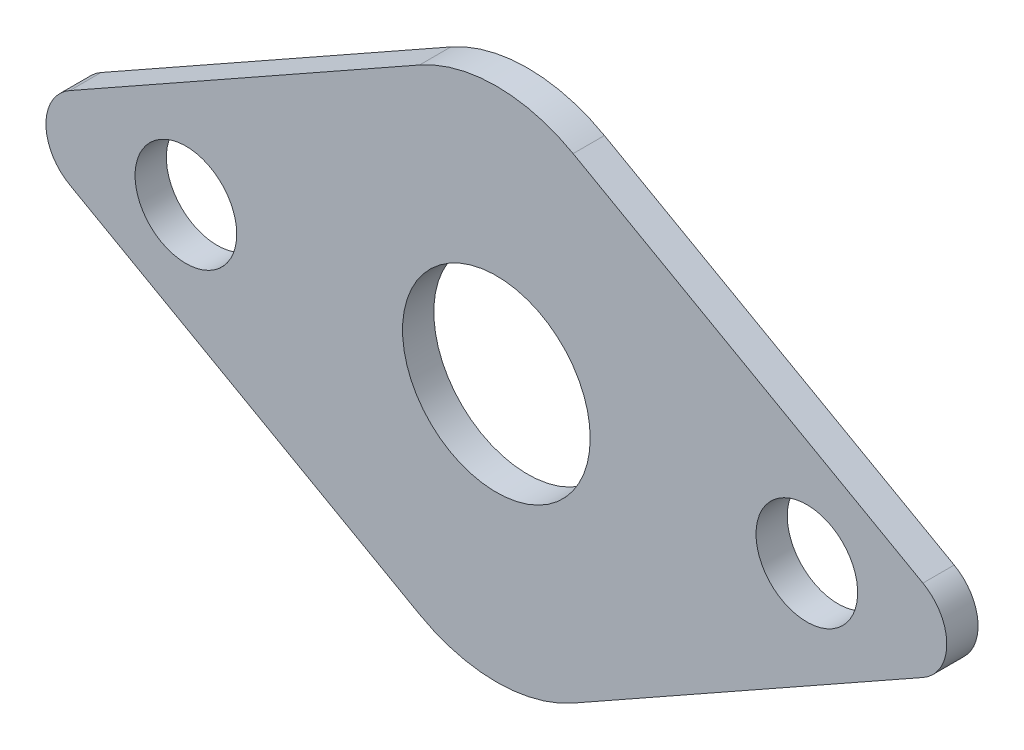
ISO-10303-21;
HEADER;
FILE_DESCRIPTION(('STEP AP214'),'2;1');
FILE_NAME('part.step','',(''),(''),'','','');
FILE_SCHEMA(('AUTOMOTIVE_DESIGN { 1 0 10303 214 1 1 1 1 }'));
ENDSEC;
DATA;
#1=APPLICATION_CONTEXT('core data for automotive mechanical design processes');
#2=APPLICATION_PROTOCOL_DEFINITION('international standard','automotive_design',2000,#1);
#3=PRODUCT_CONTEXT('',#1,'mechanical');
#4=PRODUCT('Part','Part','',(#3));
#5=PRODUCT_RELATED_PRODUCT_CATEGORY('part','',(#4));
#6=PRODUCT_DEFINITION_FORMATION('','',#4);
#7=PRODUCT_DEFINITION_CONTEXT('part definition',#1,'design');
#8=PRODUCT_DEFINITION('design','',#6,#7);
#9=PRODUCT_DEFINITION_SHAPE('','',#8);
#10=(LENGTH_UNIT() NAMED_UNIT(*) SI_UNIT(.MILLI.,.METRE.));
#11=(NAMED_UNIT(*) PLANE_ANGLE_UNIT() SI_UNIT($,.RADIAN.));
#12=(NAMED_UNIT(*) SI_UNIT($,.STERADIAN.) SOLID_ANGLE_UNIT());
#13=UNCERTAINTY_MEASURE_WITH_UNIT(LENGTH_MEASURE(1.E-05),#10,'distance_accuracy_value','');
#14=(GEOMETRIC_REPRESENTATION_CONTEXT(3) GLOBAL_UNCERTAINTY_ASSIGNED_CONTEXT((#13)) GLOBAL_UNIT_ASSIGNED_CONTEXT((#10,
#11,#12)) REPRESENTATION_CONTEXT('',''));
#15=CARTESIAN_POINT('',(0.,0.,0.));
#16=DIRECTION('',(0.,0.,1.));
#17=DIRECTION('',(1.,0.,0.));
#18=AXIS2_PLACEMENT_3D('',#15,#16,#17);
#19=CARTESIAN_POINT('',(12.9,0.,1.));
#20=DIRECTION('',(0.,0.,-1.));
#21=DIRECTION('',(-1.,0.,0.));
#22=AXIS2_PLACEMENT_3D('',#19,#20,#21);
#23=CYLINDRICAL_SURFACE('',#22,1.49999999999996);
#24=CARTESIAN_POINT('',(12.9,0.,0.));
#25=DIRECTION('',(0.,0.,1.));
#26=DIRECTION('',(-1.,0.,0.));
#27=AXIS2_PLACEMENT_3D('',#24,#25,#26);
#28=CIRCLE('',#27,1.49999999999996);
#29=CARTESIAN_POINT('',(13.6362320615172,-1.30689033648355,0.));
#30=VERTEX_POINT('',#29);
#31=CARTESIAN_POINT('',(13.6362320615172,1.30689033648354,0.));
#32=VERTEX_POINT('',#31);
#33=EDGE_CURVE('E112',#30,#32,#28,.T.);
#34=ORIENTED_EDGE('',*,*,#33,.T.);
#35=DIRECTION('',(0.,0.,-1.));
#36=VECTOR('',#35,1.);
#37=CARTESIAN_POINT('',(13.6362320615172,1.30689033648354,1.));
#38=LINE('',#37,#36);
#39=CARTESIAN_POINT('',(13.6362320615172,1.30689033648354,1.));
#40=VERTEX_POINT('',#39);
#41=EDGE_CURVE('E10',#40,#32,#38,.T.);
#42=ORIENTED_EDGE('',*,*,#41,.F.);
#43=CARTESIAN_POINT('',(12.9,0.,1.));
#44=DIRECTION('',(0.,0.,1.));
#45=DIRECTION('',(-1.,0.,0.));
#46=AXIS2_PLACEMENT_3D('',#43,#44,#45);
#47=CIRCLE('',#46,1.49999999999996);
#48=CARTESIAN_POINT('',(13.6362320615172,-1.30689033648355,1.));
#49=VERTEX_POINT('',#48);
#50=EDGE_CURVE('E127',#49,#40,#47,.T.);
#51=ORIENTED_EDGE('',*,*,#50,.F.);
#52=DIRECTION('',(0.,0.,-1.));
#53=VECTOR('',#52,1.);
#54=CARTESIAN_POINT('',(13.6362320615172,-1.30689033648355,1.));
#55=LINE('',#54,#53);
#56=EDGE_CURVE('E108',#49,#30,#55,.T.);
#57=ORIENTED_EDGE('',*,*,#56,.T.);
#58=EDGE_LOOP('',(#34,#42,#51,#57));
#59=FACE_BOUND('',#58,.T.);
#60=ADVANCED_FACE('F16',(#59),#23,.T.);
#61=CARTESIAN_POINT('',(2.45410687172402,7.60630112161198,1.));
#62=DIRECTION('',(-0.490821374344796,-0.871260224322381,0.));
#63=DIRECTION('',(0.871260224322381,-0.490821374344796,0.));
#64=AXIS2_PLACEMENT_3D('',#61,#62,#63);
#65=PLANE('',#64);
#66=DIRECTION('',(-0.871260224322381,0.490821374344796,0.));
#67=VECTOR('',#66,1.);
#68=CARTESIAN_POINT('',(2.45410687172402,7.60630112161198,0.));
#69=LINE('',#68,#67);
#70=CARTESIAN_POINT('',(2.45410687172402,7.60630112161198,0.));
#71=VERTEX_POINT('',#70);
#72=EDGE_CURVE('E115',#32,#71,#69,.T.);
#73=ORIENTED_EDGE('',*,*,#72,.T.);
#74=DIRECTION('',(0.,0.,-1.));
#75=VECTOR('',#74,1.);
#76=CARTESIAN_POINT('',(2.45410687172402,7.60630112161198,1.));
#77=LINE('',#76,#75);
#78=CARTESIAN_POINT('',(2.45410687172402,7.60630112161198,1.));
#79=VERTEX_POINT('',#78);
#80=EDGE_CURVE('E24',#79,#71,#77,.T.);
#81=ORIENTED_EDGE('',*,*,#80,.F.);
#82=DIRECTION('',(-0.871260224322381,0.490821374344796,0.));
#83=VECTOR('',#82,1.);
#84=CARTESIAN_POINT('',(2.45410687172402,7.60630112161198,1.));
#85=LINE('',#84,#83);
#86=EDGE_CURVE('E75',#40,#79,#85,.T.);
#87=ORIENTED_EDGE('',*,*,#86,.F.);
#88=ORIENTED_EDGE('',*,*,#41,.T.);
#89=EDGE_LOOP('',(#73,#81,#87,#88));
#90=FACE_BOUND('',#89,.T.);
#91=ADVANCED_FACE('F207',(#90),#65,.F.);
#92=CARTESIAN_POINT('',(0.,3.24999999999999,1.));
#93=DIRECTION('',(0.,0.,-1.));
#94=DIRECTION('',(-1.,0.,0.));
#95=AXIS2_PLACEMENT_3D('',#92,#93,#94);
#96=CYLINDRICAL_SURFACE('',#95,5.00000000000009);
#97=CARTESIAN_POINT('',(0.,3.24999999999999,0.));
#98=DIRECTION('',(0.,0.,1.));
#99=DIRECTION('',(-1.,0.,0.));
#100=AXIS2_PLACEMENT_3D('',#97,#98,#99);
#101=CIRCLE('',#100,5.00000000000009);
#102=CARTESIAN_POINT('',(-2.45410687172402,7.60630112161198,0.));
#103=VERTEX_POINT('',#102);
#104=EDGE_CURVE('E118',#71,#103,#101,.T.);
#105=ORIENTED_EDGE('',*,*,#104,.T.);
#106=DIRECTION('',(0.,0.,-1.));
#107=VECTOR('',#106,1.);
#108=CARTESIAN_POINT('',(-2.45410687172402,7.60630112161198,1.));
#109=LINE('',#108,#107);
#110=CARTESIAN_POINT('',(-2.45410687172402,7.60630112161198,1.));
#111=VERTEX_POINT('',#110);
#112=EDGE_CURVE('E134',#111,#103,#109,.T.);
#113=ORIENTED_EDGE('',*,*,#112,.F.);
#114=CARTESIAN_POINT('',(0.,3.24999999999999,1.));
#115=DIRECTION('',(0.,0.,1.));
#116=DIRECTION('',(-1.,0.,0.));
#117=AXIS2_PLACEMENT_3D('',#114,#115,#116);
#118=CIRCLE('',#117,5.00000000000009);
#119=EDGE_CURVE('E142',#79,#111,#118,.T.);
#120=ORIENTED_EDGE('',*,*,#119,.F.);
#121=ORIENTED_EDGE('',*,*,#80,.T.);
#122=EDGE_LOOP('',(#105,#113,#120,#121));
#123=FACE_BOUND('',#122,.T.);
#124=ADVANCED_FACE('F140',(#123),#96,.T.);
#125=CARTESIAN_POINT('',(-2.45410687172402,7.60630112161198,1.));
#126=DIRECTION('',(0.490821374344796,-0.871260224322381,0.));
#127=DIRECTION('',(0.871260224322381,0.490821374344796,0.));
#128=AXIS2_PLACEMENT_3D('',#125,#126,#127);
#129=PLANE('',#128);
#130=DIRECTION('',(-0.871260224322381,-0.490821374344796,0.));
#131=VECTOR('',#130,1.);
#132=CARTESIAN_POINT('',(-2.45410687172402,7.60630112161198,0.));
#133=LINE('',#132,#131);
#134=CARTESIAN_POINT('',(-13.6362320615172,1.30689033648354,0.));
#135=VERTEX_POINT('',#134);
#136=EDGE_CURVE('E120',#103,#135,#133,.T.);
#137=ORIENTED_EDGE('',*,*,#136,.T.);
#138=DIRECTION('',(0.,0.,-1.));
#139=VECTOR('',#138,1.);
#140=CARTESIAN_POINT('',(-13.6362320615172,1.30689033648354,1.));
#141=LINE('',#140,#139);
#142=CARTESIAN_POINT('',(-13.6362320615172,1.30689033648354,1.));
#143=VERTEX_POINT('',#142);
#144=EDGE_CURVE('E131',#143,#135,#141,.T.);
#145=ORIENTED_EDGE('',*,*,#144,.F.);
#146=DIRECTION('',(-0.871260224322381,-0.490821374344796,0.));
#147=VECTOR('',#146,1.);
#148=CARTESIAN_POINT('',(-2.45410687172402,7.60630112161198,1.));
#149=LINE('',#148,#147);
#150=EDGE_CURVE('E154',#111,#143,#149,.T.);
#151=ORIENTED_EDGE('',*,*,#150,.F.);
#152=ORIENTED_EDGE('',*,*,#112,.T.);
#153=EDGE_LOOP('',(#137,#145,#151,#152));
#154=FACE_BOUND('',#153,.T.);
#155=ADVANCED_FACE('F150',(#154),#129,.F.);
#156=CARTESIAN_POINT('',(-12.9,0.,1.));
#157=DIRECTION('',(0.,0.,-1.));
#158=DIRECTION('',(-1.,0.,0.));
#159=AXIS2_PLACEMENT_3D('',#156,#157,#158);
#160=CYLINDRICAL_SURFACE('',#159,1.49999999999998);
#161=CARTESIAN_POINT('',(-12.9,0.,0.));
#162=DIRECTION('',(0.,0.,1.));
#163=DIRECTION('',(1.,0.,0.));
#164=AXIS2_PLACEMENT_3D('',#161,#162,#163);
#165=CIRCLE('',#164,1.49999999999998);
#166=CARTESIAN_POINT('',(-13.6362320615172,-1.30689033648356,0.));
#167=VERTEX_POINT('',#166);
#168=EDGE_CURVE('E122',#135,#167,#165,.T.);
#169=ORIENTED_EDGE('',*,*,#168,.T.);
#170=DIRECTION('',(0.,0.,-1.));
#171=VECTOR('',#170,1.);
#172=CARTESIAN_POINT('',(-13.6362320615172,-1.30689033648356,1.));
#173=LINE('',#172,#171);
#174=CARTESIAN_POINT('',(-13.6362320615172,-1.30689033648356,1.));
#175=VERTEX_POINT('',#174);
#176=EDGE_CURVE('E103',#175,#167,#173,.T.);
#177=ORIENTED_EDGE('',*,*,#176,.F.);
#178=CARTESIAN_POINT('',(-12.9,0.,1.));
#179=DIRECTION('',(0.,0.,1.));
#180=DIRECTION('',(1.,0.,0.));
#181=AXIS2_PLACEMENT_3D('',#178,#179,#180);
#182=CIRCLE('',#181,1.49999999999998);
#183=EDGE_CURVE('E94',#143,#175,#182,.T.);
#184=ORIENTED_EDGE('',*,*,#183,.F.);
#185=ORIENTED_EDGE('',*,*,#144,.T.);
#186=EDGE_LOOP('',(#169,#177,#184,#185));
#187=FACE_BOUND('',#186,.T.);
#188=ADVANCED_FACE('F153',(#187),#160,.T.);
#189=CARTESIAN_POINT('',(-2.45410687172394,-7.60630112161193,1.));
#190=DIRECTION('',(0.490821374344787,0.871260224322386,0.));
#191=DIRECTION('',(-0.871260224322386,0.490821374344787,0.));
#192=AXIS2_PLACEMENT_3D('',#189,#190,#191);
#193=PLANE('',#192);
#194=DIRECTION('',(0.871260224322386,-0.490821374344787,0.));
#195=VECTOR('',#194,1.);
#196=CARTESIAN_POINT('',(-2.45410687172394,-7.60630112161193,0.));
#197=LINE('',#196,#195);
#198=CARTESIAN_POINT('',(-2.45410687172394,-7.60630112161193,0.));
#199=VERTEX_POINT('',#198);
#200=EDGE_CURVE('E102',#167,#199,#197,.T.);
#201=ORIENTED_EDGE('',*,*,#200,.T.);
#202=DIRECTION('',(0.,0.,-1.));
#203=VECTOR('',#202,1.);
#204=CARTESIAN_POINT('',(-2.45410687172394,-7.60630112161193,1.));
#205=LINE('',#204,#203);
#206=CARTESIAN_POINT('',(-2.45410687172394,-7.60630112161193,1.));
#207=VERTEX_POINT('',#206);
#208=EDGE_CURVE('E99',#207,#199,#205,.T.);
#209=ORIENTED_EDGE('',*,*,#208,.F.);
#210=DIRECTION('',(0.871260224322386,-0.490821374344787,0.));
#211=VECTOR('',#210,1.);
#212=CARTESIAN_POINT('',(-2.45410687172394,-7.60630112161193,1.));
#213=LINE('',#212,#211);
#214=EDGE_CURVE('E88',#175,#207,#213,.T.);
#215=ORIENTED_EDGE('',*,*,#214,.F.);
#216=ORIENTED_EDGE('',*,*,#176,.T.);
#217=EDGE_LOOP('',(#201,#209,#215,#216));
#218=FACE_BOUND('',#217,.T.);
#219=ADVANCED_FACE('F100',(#218),#193,.F.);
#220=CARTESIAN_POINT('',(0.,-3.25,1.));
#221=DIRECTION('',(0.,0.,-1.));
#222=DIRECTION('',(-1.,0.,0.));
#223=AXIS2_PLACEMENT_3D('',#220,#221,#222);
#224=CYLINDRICAL_SURFACE('',#223,5.00000000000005);
#225=CARTESIAN_POINT('',(0.,-3.25,0.));
#226=DIRECTION('',(0.,0.,1.));
#227=DIRECTION('',(-1.,0.,0.));
#228=AXIS2_PLACEMENT_3D('',#225,#226,#227);
#229=CIRCLE('',#228,5.00000000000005);
#230=CARTESIAN_POINT('',(2.45410687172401,-7.60630112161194,0.));
#231=VERTEX_POINT('',#230);
#232=EDGE_CURVE('E61',#199,#231,#229,.T.);
#233=ORIENTED_EDGE('',*,*,#232,.T.);
#234=DIRECTION('',(0.,0.,-1.));
#235=VECTOR('',#234,1.);
#236=CARTESIAN_POINT('',(2.45410687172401,-7.60630112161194,1.));
#237=LINE('',#236,#235);
#238=CARTESIAN_POINT('',(2.45410687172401,-7.60630112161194,1.));
#239=VERTEX_POINT('',#238);
#240=EDGE_CURVE('E104',#239,#231,#237,.T.);
#241=ORIENTED_EDGE('',*,*,#240,.F.);
#242=CARTESIAN_POINT('',(0.,-3.25,1.));
#243=DIRECTION('',(0.,0.,1.));
#244=DIRECTION('',(-1.,0.,0.));
#245=AXIS2_PLACEMENT_3D('',#242,#243,#244);
#246=CIRCLE('',#245,5.00000000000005);
#247=EDGE_CURVE('E92',#207,#239,#246,.T.);
#248=ORIENTED_EDGE('',*,*,#247,.F.);
#249=ORIENTED_EDGE('',*,*,#208,.T.);
#250=EDGE_LOOP('',(#233,#241,#248,#249));
#251=FACE_BOUND('',#250,.T.);
#252=ADVANCED_FACE('F106',(#251),#224,.T.);
#253=CARTESIAN_POINT('',(13.6362320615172,-1.30689033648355,1.));
#254=DIRECTION('',(-0.490821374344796,0.871260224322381,0.));
#255=DIRECTION('',(-0.871260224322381,-0.490821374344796,0.));
#256=AXIS2_PLACEMENT_3D('',#253,#254,#255);
#257=PLANE('',#256);
#258=DIRECTION('',(0.871260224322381,0.490821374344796,0.));
#259=VECTOR('',#258,1.);
#260=CARTESIAN_POINT('',(13.6362320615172,-1.30689033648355,0.));
#261=LINE('',#260,#259);
#262=EDGE_CURVE('E67',#231,#30,#261,.T.);
#263=ORIENTED_EDGE('',*,*,#262,.T.);
#264=ORIENTED_EDGE('',*,*,#56,.F.);
#265=DIRECTION('',(0.871260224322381,0.490821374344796,0.));
#266=VECTOR('',#265,1.);
#267=CARTESIAN_POINT('',(13.6362320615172,-1.30689033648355,1.));
#268=LINE('',#267,#266);
#269=EDGE_CURVE('E32',#239,#49,#268,.T.);
#270=ORIENTED_EDGE('',*,*,#269,.F.);
#271=ORIENTED_EDGE('',*,*,#240,.T.);
#272=EDGE_LOOP('',(#263,#264,#270,#271));
#273=FACE_BOUND('',#272,.T.);
#274=ADVANCED_FACE('F190',(#273),#257,.F.);
#275=CARTESIAN_POINT('',(12.9,0.,1.));
#276=DIRECTION('',(0.,0.,-1.));
#277=DIRECTION('',(-1.,0.,0.));
#278=AXIS2_PLACEMENT_3D('',#275,#276,#277);
#279=PLANE('',#278);
#280=CARTESIAN_POINT('',(9.92499999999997,0.,1.));
#281=DIRECTION('',(0.,0.,1.));
#282=DIRECTION('',(-1.,0.,0.));
#283=AXIS2_PLACEMENT_3D('',#280,#281,#282);
#284=CIRCLE('',#283,1.625);
#285=CARTESIAN_POINT('',(8.29999999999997,0.,1.));
#286=VERTEX_POINT('',#285);
#287=EDGE_CURVE('E166',#286,#286,#284,.T.);
#288=ORIENTED_EDGE('',*,*,#287,.F.);
#289=EDGE_LOOP('',(#288));
#290=FACE_BOUND('',#289,.T.);
#291=CARTESIAN_POINT('',(-9.92499999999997,0.,1.));
#292=DIRECTION('',(0.,0.,1.));
#293=DIRECTION('',(1.,0.,0.));
#294=AXIS2_PLACEMENT_3D('',#291,#292,#293);
#295=CIRCLE('',#294,1.625);
#296=CARTESIAN_POINT('',(-8.29999999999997,0.,1.));
#297=VERTEX_POINT('',#296);
#298=EDGE_CURVE('E172',#297,#297,#295,.T.);
#299=ORIENTED_EDGE('',*,*,#298,.F.);
#300=EDGE_LOOP('',(#299));
#301=FACE_BOUND('',#300,.T.);
#302=CARTESIAN_POINT('',(0.,0.,1.));
#303=DIRECTION('',(0.,0.,1.));
#304=DIRECTION('',(1.,0.,0.));
#305=AXIS2_PLACEMENT_3D('',#302,#303,#304);
#306=CIRCLE('',#305,3.);
#307=CARTESIAN_POINT('',(3.,0.,1.));
#308=VERTEX_POINT('',#307);
#309=EDGE_CURVE('E160',#308,#308,#306,.T.);
#310=ORIENTED_EDGE('',*,*,#309,.F.);
#311=EDGE_LOOP('',(#310));
#312=FACE_BOUND('',#311,.T.);
#313=ORIENTED_EDGE('',*,*,#50,.T.);
#314=ORIENTED_EDGE('',*,*,#86,.T.);
#315=ORIENTED_EDGE('',*,*,#119,.T.);
#316=ORIENTED_EDGE('',*,*,#150,.T.);
#317=ORIENTED_EDGE('',*,*,#183,.T.);
#318=ORIENTED_EDGE('',*,*,#214,.T.);
#319=ORIENTED_EDGE('',*,*,#247,.T.);
#320=ORIENTED_EDGE('',*,*,#269,.T.);
#321=EDGE_LOOP('',(#313,#314,#315,#316,#317,#318,#319,#320));
#322=FACE_BOUND('',#321,.T.);
#323=ADVANCED_FACE('F90',(#290,#301,#312,#322),#279,.F.);
#324=CARTESIAN_POINT('',(12.9,0.,0.));
#325=DIRECTION('',(0.,0.,-1.));
#326=DIRECTION('',(-1.,0.,0.));
#327=AXIS2_PLACEMENT_3D('',#324,#325,#326);
#328=PLANE('',#327);
#329=CARTESIAN_POINT('',(9.92499999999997,0.,0.));
#330=DIRECTION('',(0.,0.,1.));
#331=DIRECTION('',(-1.,0.,0.));
#332=AXIS2_PLACEMENT_3D('',#329,#330,#331);
#333=CIRCLE('',#332,1.625);
#334=CARTESIAN_POINT('',(8.29999999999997,0.,0.));
#335=VERTEX_POINT('',#334);
#336=EDGE_CURVE('E169',#335,#335,#333,.T.);
#337=ORIENTED_EDGE('',*,*,#336,.T.);
#338=EDGE_LOOP('',(#337));
#339=FACE_BOUND('',#338,.T.);
#340=CARTESIAN_POINT('',(-9.92499999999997,0.,0.));
#341=DIRECTION('',(0.,0.,1.));
#342=DIRECTION('',(1.,0.,0.));
#343=AXIS2_PLACEMENT_3D('',#340,#341,#342);
#344=CIRCLE('',#343,1.625);
#345=CARTESIAN_POINT('',(-8.29999999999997,0.,0.));
#346=VERTEX_POINT('',#345);
#347=EDGE_CURVE('E163',#346,#346,#344,.T.);
#348=ORIENTED_EDGE('',*,*,#347,.T.);
#349=EDGE_LOOP('',(#348));
#350=FACE_BOUND('',#349,.T.);
#351=CARTESIAN_POINT('',(0.,0.,0.));
#352=DIRECTION('',(0.,0.,1.));
#353=DIRECTION('',(1.,0.,0.));
#354=AXIS2_PLACEMENT_3D('',#351,#352,#353);
#355=CIRCLE('',#354,3.);
#356=CARTESIAN_POINT('',(3.,0.,0.));
#357=VERTEX_POINT('',#356);
#358=EDGE_CURVE('E116',#357,#357,#355,.T.);
#359=ORIENTED_EDGE('',*,*,#358,.T.);
#360=EDGE_LOOP('',(#359));
#361=FACE_BOUND('',#360,.T.);
#362=ORIENTED_EDGE('',*,*,#33,.F.);
#363=ORIENTED_EDGE('',*,*,#262,.F.);
#364=ORIENTED_EDGE('',*,*,#232,.F.);
#365=ORIENTED_EDGE('',*,*,#200,.F.);
#366=ORIENTED_EDGE('',*,*,#168,.F.);
#367=ORIENTED_EDGE('',*,*,#136,.F.);
#368=ORIENTED_EDGE('',*,*,#104,.F.);
#369=ORIENTED_EDGE('',*,*,#72,.F.);
#370=EDGE_LOOP('',(#362,#363,#364,#365,#366,#367,#368,#369));
#371=FACE_BOUND('',#370,.T.);
#372=ADVANCED_FACE('F146',(#339,#350,#361,#371),#328,.T.);
#373=CARTESIAN_POINT('',(0.,0.,0.));
#374=DIRECTION('',(0.,0.,1.));
#375=DIRECTION('',(1.,0.,0.));
#376=AXIS2_PLACEMENT_3D('',#373,#374,#375);
#377=CYLINDRICAL_SURFACE('',#376,3.);
#378=ORIENTED_EDGE('',*,*,#358,.F.);
#379=EDGE_LOOP('',(#378));
#380=FACE_BOUND('',#379,.T.);
#381=ORIENTED_EDGE('',*,*,#309,.T.);
#382=EDGE_LOOP('',(#381));
#383=FACE_BOUND('',#382,.T.);
#384=ADVANCED_FACE('F184',(#380,#383),#377,.F.);
#385=CARTESIAN_POINT('',(-9.92499999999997,0.,0.));
#386=DIRECTION('',(0.,0.,1.));
#387=DIRECTION('',(1.,0.,0.));
#388=AXIS2_PLACEMENT_3D('',#385,#386,#387);
#389=CYLINDRICAL_SURFACE('',#388,1.625);
#390=ORIENTED_EDGE('',*,*,#347,.F.);
#391=EDGE_LOOP('',(#390));
#392=FACE_BOUND('',#391,.T.);
#393=ORIENTED_EDGE('',*,*,#298,.T.);
#394=EDGE_LOOP('',(#393));
#395=FACE_BOUND('',#394,.T.);
#396=ADVANCED_FACE('F180',(#392,#395),#389,.F.);
#397=CARTESIAN_POINT('',(9.92499999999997,0.,0.));
#398=DIRECTION('',(0.,0.,1.));
#399=DIRECTION('',(1.,0.,0.));
#400=AXIS2_PLACEMENT_3D('',#397,#398,#399);
#401=CYLINDRICAL_SURFACE('',#400,1.625);
#402=ORIENTED_EDGE('',*,*,#336,.F.);
#403=EDGE_LOOP('',(#402));
#404=FACE_BOUND('',#403,.T.);
#405=ORIENTED_EDGE('',*,*,#287,.T.);
#406=EDGE_LOOP('',(#405));
#407=FACE_BOUND('',#406,.T.);
#408=ADVANCED_FACE('F183',(#404,#407),#401,.F.);
#409=CLOSED_SHELL('',(#60,#91,#124,#155,#188,#219,#252,#274,#323,#372,#384,#396,#408));
#410=MANIFOLD_SOLID_BREP('B1',#409);
#411=ADVANCED_BREP_SHAPE_REPRESENTATION('',(#18,#410),#14);
#412=SHAPE_DEFINITION_REPRESENTATION(#9,#411);
ENDSEC;
END-ISO-10303-21;
